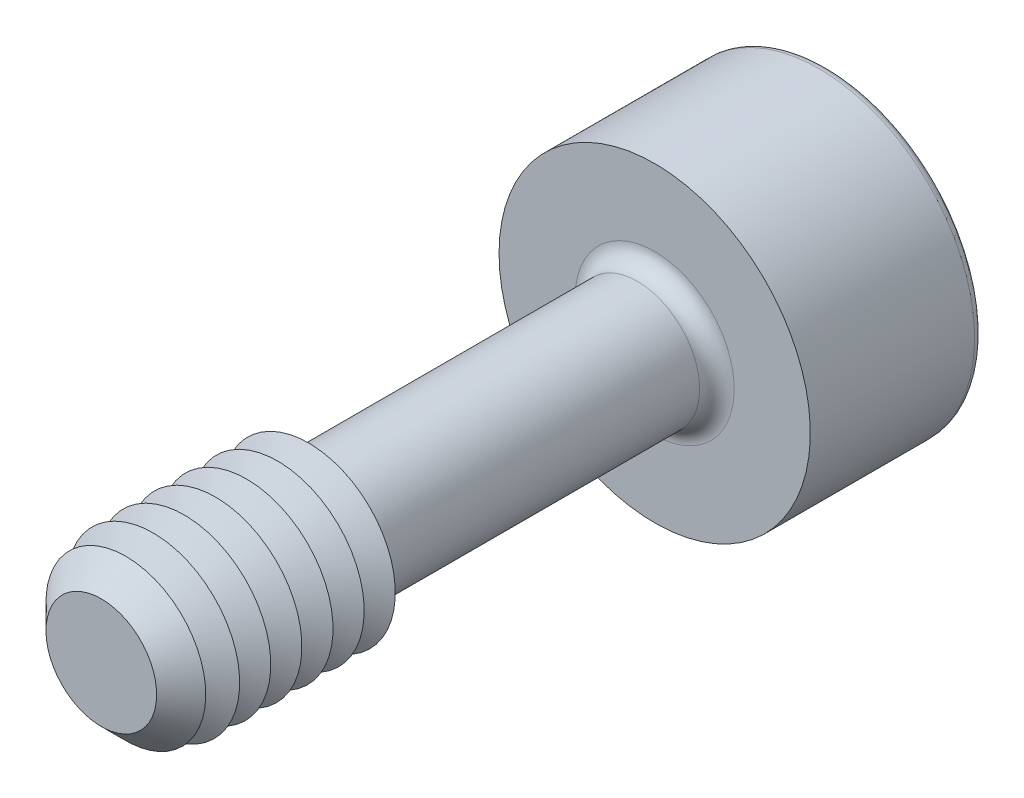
from build123d import *

# Parameters (mm, degrees)
SKETCH1_R       = 0.9
EXTRUDE1_DEPTH  = 4
CHAMFER1_SIZE   = 0.45
SKETCH3_R       = 2.25
EXTRUDE2_DEPTH  = 2.5
EXTRUDE3_DEPTH  = 2
FILLET1_R       = 0.25
FILLET2_R       = 0.125
LPATTERN1_COUNT = 6
LPATTERN1_PITCH = 0.45


with BuildPart() as part:
    # Sketch1 → Extrude1 (new, symmetric)
    with BuildSketch(Plane.XY):
        Circle(SKETCH1_R)
    extrude(amount=EXTRUDE1_DEPTH, both=True)

    # Sketch2 → Revolve1 (revolve)
    with BuildSketch(Plane(origin=(0, 0, 0), x_dir=(0, 0, -1), z_dir=(1, 0, 0))):
        Polygon((-4, 0), (-4, 1.25), (-1, 1.25), (-0.797927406, 0.9), (-0.797927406, 0), align=None)
    revolve(axis=Axis((0, 0, 0.797927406), (0, 0, 1)))

    # Chamfer1
    chamfer1_edges = [part.edges().sort_by_distance(p)[0] for p in [
        (0, -1.25, 4),
    ]]
    chamfer(chamfer1_edges, length=CHAMFER1_SIZE)

    # Sketch3 → Extrude2 (add)
    with BuildSketch(Plane(origin=(0, 0, -4), x_dir=(-1, 0, 0), z_dir=(0, 0, -1))):
        Circle(SKETCH3_R)
    extrude(amount=EXTRUDE2_DEPTH)

    # Sketch4 → Extrude3 (cut)
    with BuildSketch(Plane(origin=(-13.7, 0, -6.5), x_dir=(1, 0, 0), z_dir=(0, 0, 1))):
        Polygon((13.122649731, -1), (14.277350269, -1), (14.854700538, 0), (14.277350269, 1), (13.122649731, 1), (12.545299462, 0), align=None)
    extrude(amount=EXTRUDE3_DEPTH, mode=Mode.SUBTRACT)

    # Fillet1
    fillet1_edges = [part.edges().sort_by_distance(p)[0] for p in [
        (-0.9, 0, -4),
    ]]
    fillet(fillet1_edges, radius=FILLET1_R)

    # Fillet2
    fillet2_edges = [part.edges().sort_by_distance(p)[0] for p in [
        (2.25, 0, -6.5),
    ]]
    fillet(fillet2_edges, radius=FILLET2_R)

    # Sketch5 → Cut-Revolve1 (revolve, cut)
    with BuildSketch(Plane(origin=(0, 0, 0), x_dir=(0, 0, -1), z_dir=(1, 0, 0)), mode=Mode.PRIVATE) as cut_revolve1_sk:
        Polygon((4.5, 0), (4.5, -1), (3.922649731, 0), align=None)
    revolve(cut_revolve1_sk.sketch.rotate(Axis((0, 0, -3.922649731), (0, 0, -1)), 90), axis=Axis((0, 0, -3.922649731), (0, 0, -1)), mode=Mode.SUBTRACT)

    # Sketch7 → Cut-Revolve2 (revolve, cut)
    with BuildSketch(Plane(origin=(0, 0, 0), x_dir=(0, 0, -1), z_dir=(1, 0, 0)), mode=Mode.PRIVATE) as cut_revolve2_sk:
        Polygon((-1, 1.25), (-1.225, 0.860288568), (-1.45, 1.25), align=None)
    cut_revolve2 = revolve(cut_revolve2_sk.sketch.rotate(Axis((0, 0, -1.332048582), (0, 0, 1)), 90), axis=Axis((0, 0, -1.332048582), (0, 0, 1)), mode=Mode.SUBTRACT)

    # LPattern1: Cut-Revolve2 ×6
    with Locations(*[(0, 0, i * LPATTERN1_PITCH) for i in range(1, LPATTERN1_COUNT)]):
        add(cut_revolve2, mode=Mode.SUBTRACT)


solid = part.part
